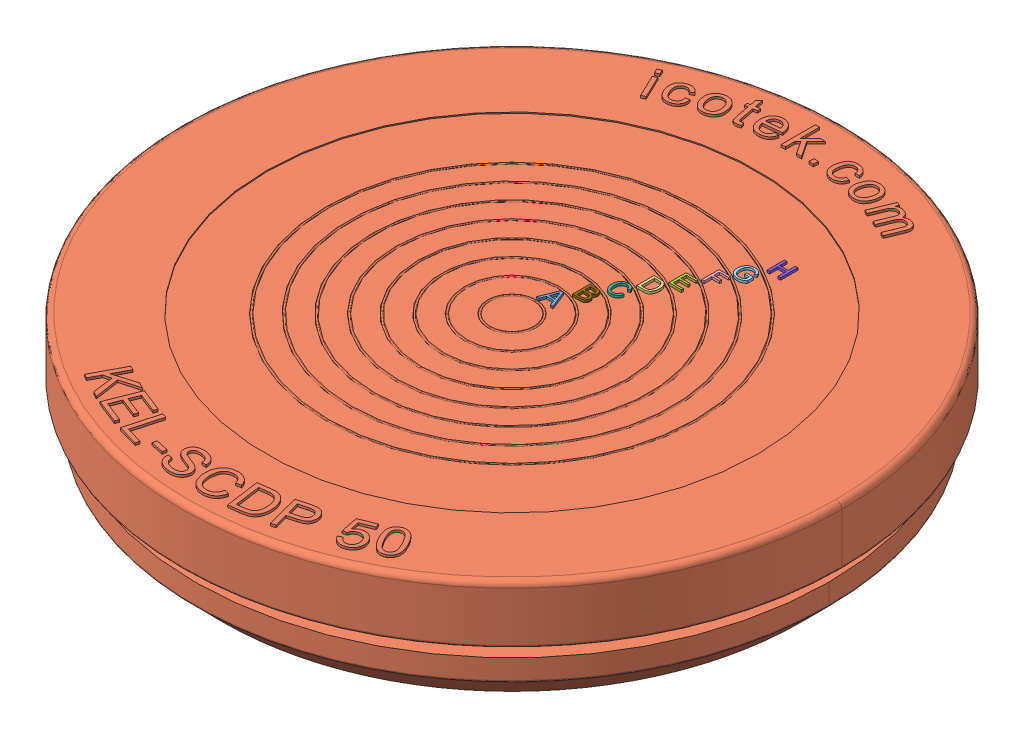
SolidWorks assembly 43483.SLDASM, configuration Default (file format 8000). Lengths in mm.
Overall size (57.2 11 57.2).
9 component instances, 9 part files, 0 mates.
Components (placement in the parent):
- 43483_01-1: 43483_01.SLDPRT [Default] at origin size (1.43 0.2 1.5)
- 43483_02-1: 43483_02.SLDPRT [Default] at origin size (57.2 11 57.2)
- 43483_03-1: 43483_03.SLDPRT [Default] at origin size (1.23 0.2 1.5)
- 43483_04-1: 43483_04.SLDPRT [Default] at origin size (1 0.2 1.5)
- 43483_05-1: 43483_05.SLDPRT [Default] at origin size (1.38 0.2 1.54)
- 43483_06-1: 43483_06.SLDPRT [Default] at origin size (1.31 0.2 1.54)
- 43483_07-1: 43483_07.SLDPRT [Default] at origin size (1.1 0.2 1.5)
- 43483_08-1: 43483_08.SLDPRT [Default] at origin size (1.15 0.2 1.5)
- 43483_09-1: 43483_09.SLDPRT [Default] at origin size (1.12 0.2 1.5)
